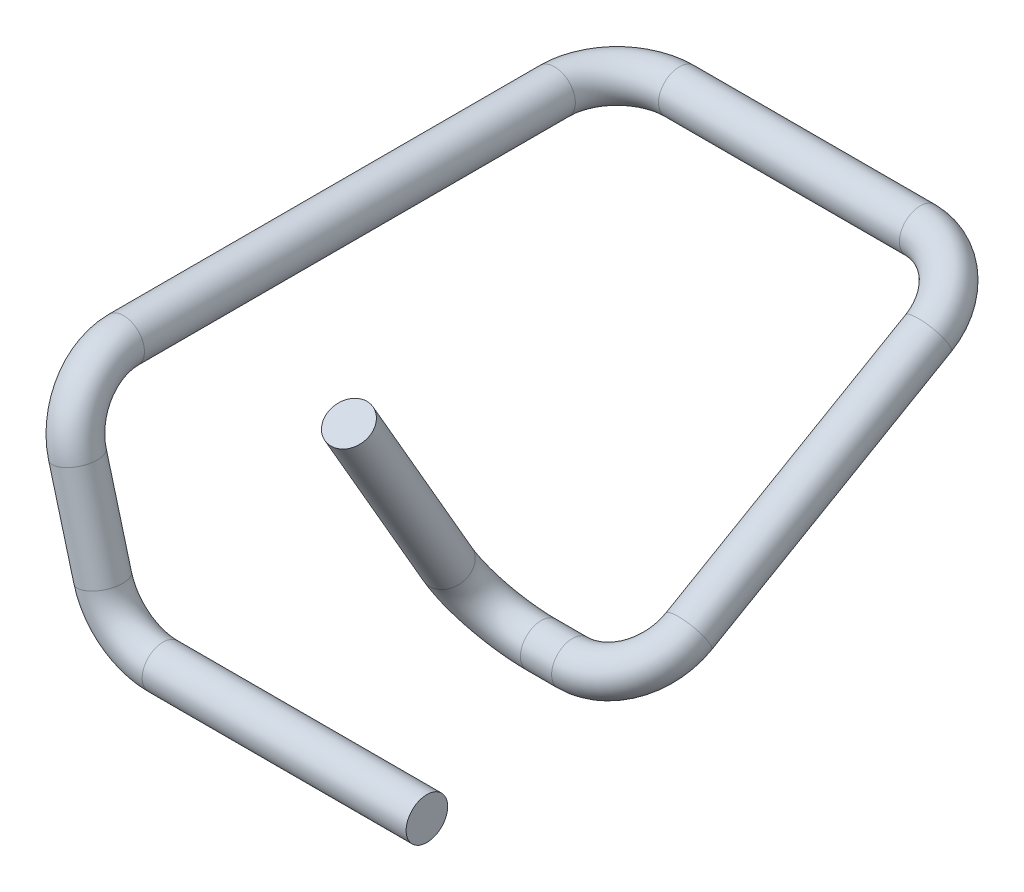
ISO-10303-21;
HEADER;
FILE_DESCRIPTION(('STEP AP214'),'2;1');
FILE_NAME('part.step','',(''),(''),'','','');
FILE_SCHEMA(('AUTOMOTIVE_DESIGN { 1 0 10303 214 1 1 1 1 }'));
ENDSEC;
DATA;
#1=APPLICATION_CONTEXT('core data for automotive mechanical design processes');
#2=APPLICATION_PROTOCOL_DEFINITION('international standard','automotive_design',2000,#1);
#3=PRODUCT_CONTEXT('',#1,'mechanical');
#4=PRODUCT('Part','Part','',(#3));
#5=PRODUCT_RELATED_PRODUCT_CATEGORY('part','',(#4));
#6=PRODUCT_DEFINITION_FORMATION('','',#4);
#7=PRODUCT_DEFINITION_CONTEXT('part definition',#1,'design');
#8=PRODUCT_DEFINITION('design','',#6,#7);
#9=PRODUCT_DEFINITION_SHAPE('','',#8);
#10=(LENGTH_UNIT() NAMED_UNIT(*) SI_UNIT(.MILLI.,.METRE.));
#11=(NAMED_UNIT(*) PLANE_ANGLE_UNIT() SI_UNIT($,.RADIAN.));
#12=(NAMED_UNIT(*) SI_UNIT($,.STERADIAN.) SOLID_ANGLE_UNIT());
#13=UNCERTAINTY_MEASURE_WITH_UNIT(LENGTH_MEASURE(1.E-05),#10,'distance_accuracy_value','');
#14=(GEOMETRIC_REPRESENTATION_CONTEXT(3) GLOBAL_UNCERTAINTY_ASSIGNED_CONTEXT((#13)) GLOBAL_UNIT_ASSIGNED_CONTEXT((#10,
#11,#12)) REPRESENTATION_CONTEXT('',''));
#15=CARTESIAN_POINT('',(0.,0.,0.));
#16=DIRECTION('',(0.,0.,1.));
#17=DIRECTION('',(1.,0.,0.));
#18=AXIS2_PLACEMENT_3D('',#15,#16,#17);
#19=CARTESIAN_POINT('',(0.,0.,0.));
#20=DIRECTION('',(1.,0.,0.));
#21=DIRECTION('',(0.,0.707106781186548,-0.707106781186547));
#22=AXIS2_PLACEMENT_3D('',#19,#20,#21);
#23=PLANE('',#22);
#24=CARTESIAN_POINT('',(0.,0.,0.));
#25=DIRECTION('',(1.,0.,0.));
#26=DIRECTION('',(0.,0.707106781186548,-0.707106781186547));
#27=AXIS2_PLACEMENT_3D('',#24,#25,#26);
#28=CIRCLE('',#27,9.99999999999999);
#29=CARTESIAN_POINT('',(0.,7.07106781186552,-7.07106781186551));
#30=VERTEX_POINT('',#29);
#31=EDGE_CURVE('E56',#30,#30,#28,.T.);
#32=ORIENTED_EDGE('',*,*,#31,.T.);
#33=EDGE_LOOP('',(#32));
#34=FACE_BOUND('',#33,.T.);
#35=ADVANCED_FACE('F44',(#34),#23,.T.);
#36=CARTESIAN_POINT('',(-75.,108.253175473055,-37.5000000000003));
#37=DIRECTION('',(0.,-0.86602540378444,-0.499999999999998));
#38=DIRECTION('',(0.,0.499999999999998,-0.86602540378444));
#39=AXIS2_PLACEMENT_3D('',#36,#37,#38);
#40=PLANE('',#39);
#41=CARTESIAN_POINT('',(-75.,108.253175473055,-37.5000000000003));
#42=DIRECTION('',(0.,-0.86602540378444,-0.499999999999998));
#43=DIRECTION('',(0.,0.499999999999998,-0.86602540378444));
#44=AXIS2_PLACEMENT_3D('',#41,#42,#43);
#45=CIRCLE('',#44,9.99999999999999);
#46=CARTESIAN_POINT('',(-75.,113.253175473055,-46.1602540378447));
#47=VERTEX_POINT('',#46);
#48=EDGE_CURVE('E12',#47,#47,#45,.T.);
#49=ORIENTED_EDGE('',*,*,#48,.F.);
#50=EDGE_LOOP('',(#49));
#51=FACE_BOUND('',#50,.T.);
#52=ADVANCED_FACE('F62',(#51),#40,.F.);
#53=CARTESIAN_POINT('',(0.,0.,0.));
#54=DIRECTION('',(-1.,0.,0.));
#55=DIRECTION('',(0.,0.,1.));
#56=AXIS2_PLACEMENT_3D('',#53,#54,#55);
#57=CYLINDRICAL_SURFACE('',#56,9.99999999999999);
#58=CARTESIAN_POINT('',(-126.980190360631,0.,0.));
#59=DIRECTION('',(1.,0.,0.));
#60=DIRECTION('',(0.,0.707106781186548,-0.707106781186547));
#61=AXIS2_PLACEMENT_3D('',#58,#59,#60);
#62=CIRCLE('',#61,9.99999999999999);
#63=CARTESIAN_POINT('',(-126.980190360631,-9.99999999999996,0.));
#64=VERTEX_POINT('',#63);
#65=EDGE_CURVE('E128',#64,#64,#62,.T.);
#66=ORIENTED_EDGE('',*,*,#65,.T.);
#67=EDGE_LOOP('',(#66));
#68=FACE_BOUND('',#67,.T.);
#69=ORIENTED_EDGE('',*,*,#31,.F.);
#70=EDGE_LOOP('',(#69));
#71=FACE_BOUND('',#70,.T.);
#72=ADVANCED_FACE('F64',(#68,#71),#57,.T.);
#73=CARTESIAN_POINT('',(-126.980190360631,30.,0.));
#74=DIRECTION('',(0.,0.,-1.));
#75=DIRECTION('',(0.,1.,0.));
#76=AXIS2_PLACEMENT_3D('',#73,#74,#75);
#77=TOROIDAL_SURFACE('',#76,30.,9.99999999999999);
#78=CARTESIAN_POINT('',(-155.957965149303,22.2354286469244,0.));
#79=DIRECTION('',(0.258819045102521,-0.965925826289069,0.));
#80=DIRECTION('',(0.683012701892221,0.183012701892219,-0.707106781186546));
#81=AXIS2_PLACEMENT_3D('',#78,#79,#80);
#82=CIRCLE('',#81,9.99999999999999);
#83=CARTESIAN_POINT('',(-165.617223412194,19.6472381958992,0.));
#84=VERTEX_POINT('',#83);
#85=EDGE_CURVE('E125',#84,#84,#82,.T.);
#86=CARTESIAN_POINT('',(-126.980190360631,30.,0.));
#87=DIRECTION('',(0.,0.,-1.));
#88=DIRECTION('',(0.,1.,0.));
#89=AXIS2_PLACEMENT_3D('',#86,#87,#88);
#90=CIRCLE('',#89,40.);
#91=EDGE_CURVE('',#64,#84,#90,.T.);
#92=ORIENTED_EDGE('',*,*,#65,.F.);
#93=ORIENTED_EDGE('',*,*,#85,.T.);
#94=ORIENTED_EDGE('',*,*,#91,.T.);
#95=ORIENTED_EDGE('',*,*,#91,.F.);
#96=EDGE_LOOP('',(#92,#94,#93,#95));
#97=FACE_BOUND('',#96,.T.);
#98=ADVANCED_FACE('F69',(#97),#77,.T.);
#99=CARTESIAN_POINT('',(-155.957965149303,22.2354286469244,0.));
#100=DIRECTION('',(-0.25881904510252,0.965925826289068,0.));
#101=DIRECTION('',(-0.965925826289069,-0.25881904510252,0.));
#102=AXIS2_PLACEMENT_3D('',#99,#100,#101);
#103=CYLINDRICAL_SURFACE('',#102,9.99999999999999);
#104=CARTESIAN_POINT('',(-168.117333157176,67.6148078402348,0.));
#105=DIRECTION('',(0.25881904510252,-0.965925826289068,0.));
#106=DIRECTION('',(0.683012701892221,0.183012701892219,-0.707106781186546));
#107=AXIS2_PLACEMENT_3D('',#104,#105,#106);
#108=CIRCLE('',#107,9.99999999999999);
#109=CARTESIAN_POINT('',(-168.117333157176,67.6148078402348,9.99999999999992));
#110=VERTEX_POINT('',#109);
#111=EDGE_CURVE('E130',#110,#110,#108,.T.);
#112=ORIENTED_EDGE('',*,*,#111,.T.);
#113=EDGE_LOOP('',(#112));
#114=FACE_BOUND('',#113,.T.);
#115=ORIENTED_EDGE('',*,*,#85,.F.);
#116=EDGE_LOOP('',(#115));
#117=FACE_BOUND('',#116,.T.);
#118=ADVANCED_FACE('F113',(#114,#117),#103,.T.);
#119=CARTESIAN_POINT('',(-168.117333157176,67.6148078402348,-30.));
#120=DIRECTION('',(-0.965925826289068,-0.25881904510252,0.));
#121=DIRECTION('',(0.25881904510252,-0.965925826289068,0.));
#122=AXIS2_PLACEMENT_3D('',#119,#120,#121);
#123=TOROIDAL_SURFACE('',#122,30.,9.99999999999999);
#124=CARTESIAN_POINT('',(-175.881904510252,96.5925826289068,-30.0000000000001));
#125=DIRECTION('',(0.,0.,1.));
#126=DIRECTION('',(0.86602540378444,-0.499999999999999,0.));
#127=AXIS2_PLACEMENT_3D('',#124,#125,#126);
#128=CIRCLE('',#127,9.99999999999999);
#129=CARTESIAN_POINT('',(-178.470094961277,106.251840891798,-30.0000000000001));
#130=VERTEX_POINT('',#129);
#131=EDGE_CURVE('E136',#130,#130,#128,.T.);
#132=CARTESIAN_POINT('',(-168.117333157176,67.6148078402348,-30.));
#133=DIRECTION('',(-0.965925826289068,-0.25881904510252,0.));
#134=DIRECTION('',(0.25881904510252,-0.965925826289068,0.));
#135=AXIS2_PLACEMENT_3D('',#132,#133,#134);
#136=CIRCLE('',#135,40.);
#137=EDGE_CURVE('',#110,#130,#136,.T.);
#138=ORIENTED_EDGE('',*,*,#111,.F.);
#139=ORIENTED_EDGE('',*,*,#131,.T.);
#140=ORIENTED_EDGE('',*,*,#137,.T.);
#141=ORIENTED_EDGE('',*,*,#137,.F.);
#142=EDGE_LOOP('',(#138,#140,#139,#141));
#143=FACE_BOUND('',#142,.T.);
#144=ADVANCED_FACE('F109',(#143),#123,.T.);
#145=CARTESIAN_POINT('',(-175.881904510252,96.5925826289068,-30.));
#146=DIRECTION('',(0.,0.,-1.));
#147=DIRECTION('',(0.,1.,0.));
#148=AXIS2_PLACEMENT_3D('',#145,#146,#147);
#149=CYLINDRICAL_SURFACE('',#148,9.99999999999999);
#150=CARTESIAN_POINT('',(-175.881904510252,96.5925826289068,-237.303260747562));
#151=DIRECTION('',(0.,0.,1.));
#152=DIRECTION('',(0.86602540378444,-0.499999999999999,0.));
#153=AXIS2_PLACEMENT_3D('',#150,#151,#152);
#154=CIRCLE('',#153,9.99999999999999);
#155=CARTESIAN_POINT('',(-185.881904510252,96.5925826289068,-237.303260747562));
#156=VERTEX_POINT('',#155);
#157=EDGE_CURVE('E139',#156,#156,#154,.T.);
#158=ORIENTED_EDGE('',*,*,#157,.T.);
#159=EDGE_LOOP('',(#158));
#160=FACE_BOUND('',#159,.T.);
#161=ORIENTED_EDGE('',*,*,#131,.F.);
#162=EDGE_LOOP('',(#161));
#163=FACE_BOUND('',#162,.T.);
#164=ADVANCED_FACE('F105',(#160,#163),#149,.T.);
#165=CARTESIAN_POINT('',(-145.881904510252,96.5925826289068,-237.303260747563));
#166=DIRECTION('',(0.,-1.,0.));
#167=DIRECTION('',(0.,0.,-1.));
#168=AXIS2_PLACEMENT_3D('',#165,#166,#167);
#169=TOROIDAL_SURFACE('',#168,29.9999999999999,9.99999999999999);
#170=CARTESIAN_POINT('',(-145.881904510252,96.5925826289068,-267.303260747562));
#171=DIRECTION('',(-1.,0.,0.));
#172=DIRECTION('',(0.,-0.499999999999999,0.86602540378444));
#173=AXIS2_PLACEMENT_3D('',#170,#171,#172);
#174=CIRCLE('',#173,9.99999999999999);
#175=CARTESIAN_POINT('',(-145.881904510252,96.5925826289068,-277.303260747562));
#176=VERTEX_POINT('',#175);
#177=EDGE_CURVE('E142',#176,#176,#174,.T.);
#178=CARTESIAN_POINT('',(-145.881904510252,96.5925826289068,-237.303260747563));
#179=DIRECTION('',(0.,-1.,0.));
#180=DIRECTION('',(0.,0.,-1.));
#181=AXIS2_PLACEMENT_3D('',#178,#179,#180);
#182=CIRCLE('',#181,39.9999999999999);
#183=EDGE_CURVE('',#156,#176,#182,.T.);
#184=ORIENTED_EDGE('',*,*,#157,.F.);
#185=ORIENTED_EDGE('',*,*,#177,.T.);
#186=ORIENTED_EDGE('',*,*,#183,.T.);
#187=ORIENTED_EDGE('',*,*,#183,.F.);
#188=EDGE_LOOP('',(#184,#186,#185,#187));
#189=FACE_BOUND('',#188,.T.);
#190=ADVANCED_FACE('F101',(#189),#169,.T.);
#191=CARTESIAN_POINT('',(-145.881904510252,96.5925826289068,-267.303260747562));
#192=DIRECTION('',(1.,0.,0.));
#193=DIRECTION('',(0.,0.,-1.));
#194=AXIS2_PLACEMENT_3D('',#191,#192,#193);
#195=CYLINDRICAL_SURFACE('',#194,9.99999999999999);
#196=CARTESIAN_POINT('',(-30.0000000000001,96.5925826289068,-267.303260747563));
#197=DIRECTION('',(-1.,0.,0.));
#198=DIRECTION('',(0.,-0.499999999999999,0.86602540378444));
#199=AXIS2_PLACEMENT_3D('',#196,#197,#198);
#200=CIRCLE('',#199,9.99999999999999);
#201=CARTESIAN_POINT('',(-30.0000000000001,101.592582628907,-275.963514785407));
#202=VERTEX_POINT('',#201);
#203=EDGE_CURVE('E145',#202,#202,#200,.T.);
#204=ORIENTED_EDGE('',*,*,#203,.T.);
#205=EDGE_LOOP('',(#204));
#206=FACE_BOUND('',#205,.T.);
#207=ORIENTED_EDGE('',*,*,#177,.F.);
#208=EDGE_LOOP('',(#207));
#209=FACE_BOUND('',#208,.T.);
#210=ADVANCED_FACE('F97',(#206,#209),#195,.T.);
#211=CARTESIAN_POINT('',(-30.0000000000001,81.5925826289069,-241.322498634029));
#212=DIRECTION('',(0.,-0.866025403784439,-0.499999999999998));
#213=DIRECTION('',(0.,0.499999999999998,-0.86602540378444));
#214=AXIS2_PLACEMENT_3D('',#211,#212,#213);
#215=TOROIDAL_SURFACE('',#214,30.,9.99999999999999);
#216=CARTESIAN_POINT('',(-1.2490009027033E-13,81.5925826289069,-241.322498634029));
#217=DIRECTION('',(0.,0.499999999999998,-0.86602540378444));
#218=DIRECTION('',(-1.,0.,0.));
#219=AXIS2_PLACEMENT_3D('',#216,#217,#218);
#220=CIRCLE('',#219,9.99999999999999);
#221=CARTESIAN_POINT('',(9.99999999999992,81.5925826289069,-241.322498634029));
#222=VERTEX_POINT('',#221);
#223=EDGE_CURVE('E148',#222,#222,#220,.T.);
#224=CARTESIAN_POINT('',(-30.0000000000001,81.5925826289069,-241.322498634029));
#225=DIRECTION('',(0.,-0.866025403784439,-0.499999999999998));
#226=DIRECTION('',(0.,0.499999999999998,-0.86602540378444));
#227=AXIS2_PLACEMENT_3D('',#224,#225,#226);
#228=CIRCLE('',#227,40.);
#229=EDGE_CURVE('',#202,#222,#228,.T.);
#230=ORIENTED_EDGE('',*,*,#203,.F.);
#231=ORIENTED_EDGE('',*,*,#223,.T.);
#232=ORIENTED_EDGE('',*,*,#229,.T.);
#233=ORIENTED_EDGE('',*,*,#229,.F.);
#234=EDGE_LOOP('',(#230,#232,#231,#233));
#235=FACE_BOUND('',#234,.T.);
#236=ADVANCED_FACE('F93',(#235),#215,.T.);
#237=CARTESIAN_POINT('',(-1.38777878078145E-13,81.5925826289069,-241.322498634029));
#238=DIRECTION('',(0.,-0.499999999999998,0.86602540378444));
#239=DIRECTION('',(0.,-0.86602540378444,-0.499999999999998));
#240=AXIS2_PLACEMENT_3D('',#237,#238,#239);
#241=CYLINDRICAL_SURFACE('',#240,9.99999999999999);
#242=CARTESIAN_POINT('',(0.,14.9999999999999,-125.980762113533));
#243=DIRECTION('',(0.,0.499999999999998,-0.86602540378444));
#244=DIRECTION('',(-1.,0.,0.));
#245=AXIS2_PLACEMENT_3D('',#242,#243,#244);
#246=CIRCLE('',#245,9.99999999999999);
#247=CARTESIAN_POINT('',(9.99999999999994,14.9999999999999,-125.980762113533));
#248=VERTEX_POINT('',#247);
#249=EDGE_CURVE('E151',#248,#248,#246,.T.);
#250=ORIENTED_EDGE('',*,*,#249,.T.);
#251=EDGE_LOOP('',(#250));
#252=FACE_BOUND('',#251,.T.);
#253=ORIENTED_EDGE('',*,*,#223,.F.);
#254=EDGE_LOOP('',(#253));
#255=FACE_BOUND('',#254,.T.);
#256=ADVANCED_FACE('F89',(#252,#255),#241,.T.);
#257=CARTESIAN_POINT('',(-30.,14.9999999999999,-125.980762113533));
#258=DIRECTION('',(0.,-0.86602540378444,-0.499999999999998));
#259=DIRECTION('',(0.,0.499999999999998,-0.86602540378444));
#260=AXIS2_PLACEMENT_3D('',#257,#258,#259);
#261=TOROIDAL_SURFACE('',#260,30.,9.99999999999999);
#262=CARTESIAN_POINT('',(-30.,0.,-100.));
#263=DIRECTION('',(1.,0.,0.));
#264=DIRECTION('',(0.,0.499999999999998,-0.86602540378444));
#265=AXIS2_PLACEMENT_3D('',#262,#263,#264);
#266=CIRCLE('',#265,9.99999999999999);
#267=CARTESIAN_POINT('',(-30.,-4.99999999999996,-91.3397459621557));
#268=VERTEX_POINT('',#267);
#269=EDGE_CURVE('E154',#268,#268,#266,.T.);
#270=CARTESIAN_POINT('',(-30.,14.9999999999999,-125.980762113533));
#271=DIRECTION('',(0.,-0.86602540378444,-0.499999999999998));
#272=DIRECTION('',(0.,0.499999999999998,-0.86602540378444));
#273=AXIS2_PLACEMENT_3D('',#270,#271,#272);
#274=CIRCLE('',#273,40.);
#275=EDGE_CURVE('',#248,#268,#274,.T.);
#276=ORIENTED_EDGE('',*,*,#249,.F.);
#277=ORIENTED_EDGE('',*,*,#269,.T.);
#278=ORIENTED_EDGE('',*,*,#275,.T.);
#279=ORIENTED_EDGE('',*,*,#275,.F.);
#280=EDGE_LOOP('',(#276,#278,#277,#279));
#281=FACE_BOUND('',#280,.T.);
#282=ADVANCED_FACE('F85',(#281),#261,.T.);
#283=CARTESIAN_POINT('',(-30.,0.,-100.));
#284=DIRECTION('',(-1.,0.,0.));
#285=DIRECTION('',(0.,0.,1.));
#286=AXIS2_PLACEMENT_3D('',#283,#284,#285);
#287=CYLINDRICAL_SURFACE('',#286,9.99999999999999);
#288=CARTESIAN_POINT('',(-45.,0.,-100.));
#289=DIRECTION('',(1.,0.,0.));
#290=DIRECTION('',(0.,0.499999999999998,-0.86602540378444));
#291=AXIS2_PLACEMENT_3D('',#288,#289,#290);
#292=CIRCLE('',#291,9.99999999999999);
#293=CARTESIAN_POINT('',(-45.,-8.66025403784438,-105.));
#294=VERTEX_POINT('',#293);
#295=EDGE_CURVE('E157',#294,#294,#292,.T.);
#296=ORIENTED_EDGE('',*,*,#295,.T.);
#297=EDGE_LOOP('',(#296));
#298=FACE_BOUND('',#297,.T.);
#299=ORIENTED_EDGE('',*,*,#269,.F.);
#300=EDGE_LOOP('',(#299));
#301=FACE_BOUND('',#300,.T.);
#302=ADVANCED_FACE('F79',(#298,#301),#287,.T.);
#303=CARTESIAN_POINT('',(-45.,25.9807621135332,-85.0000000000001));
#304=DIRECTION('',(0.,0.499999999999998,-0.86602540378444));
#305=DIRECTION('',(0.,0.86602540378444,0.499999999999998));
#306=AXIS2_PLACEMENT_3D('',#303,#304,#305);
#307=TOROIDAL_SURFACE('',#306,30.,9.99999999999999);
#308=CARTESIAN_POINT('',(-74.9999999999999,25.9807621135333,-85.));
#309=DIRECTION('',(0.,-0.86602540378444,-0.499999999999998));
#310=DIRECTION('',(0.,0.499999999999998,-0.86602540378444));
#311=AXIS2_PLACEMENT_3D('',#308,#309,#310);
#312=CIRCLE('',#311,9.99999999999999);
#313=CARTESIAN_POINT('',(-85.,25.9807621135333,-85.));
#314=VERTEX_POINT('',#313);
#315=EDGE_CURVE('E51',#314,#314,#312,.T.);
#316=CARTESIAN_POINT('',(-45.,25.9807621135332,-85.0000000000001));
#317=DIRECTION('',(0.,0.499999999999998,-0.86602540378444));
#318=DIRECTION('',(0.,0.86602540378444,0.499999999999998));
#319=AXIS2_PLACEMENT_3D('',#316,#317,#318);
#320=CIRCLE('',#319,40.);
#321=EDGE_CURVE('',#294,#314,#320,.T.);
#322=ORIENTED_EDGE('',*,*,#295,.F.);
#323=ORIENTED_EDGE('',*,*,#315,.T.);
#324=ORIENTED_EDGE('',*,*,#321,.T.);
#325=ORIENTED_EDGE('',*,*,#321,.F.);
#326=EDGE_LOOP('',(#322,#324,#323,#325));
#327=FACE_BOUND('',#326,.T.);
#328=ADVANCED_FACE('F75',(#327),#307,.T.);
#329=CARTESIAN_POINT('',(-75.,25.9807621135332,-85.0000000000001));
#330=DIRECTION('',(0.,0.86602540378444,0.499999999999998));
#331=DIRECTION('',(0.,-0.499999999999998,0.86602540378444));
#332=AXIS2_PLACEMENT_3D('',#329,#330,#331);
#333=CYLINDRICAL_SURFACE('',#332,9.99999999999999);
#334=ORIENTED_EDGE('',*,*,#48,.T.);
#335=EDGE_LOOP('',(#334));
#336=FACE_BOUND('',#335,.T.);
#337=ORIENTED_EDGE('',*,*,#315,.F.);
#338=EDGE_LOOP('',(#337));
#339=FACE_BOUND('',#338,.T.);
#340=ADVANCED_FACE('F59',(#336,#339),#333,.T.);
#341=CLOSED_SHELL('',(#35,#52,#72,#98,#118,#144,#164,#190,#210,#236,#256,#282,#302,#328,#340));
#342=MANIFOLD_SOLID_BREP('B2',#341);
#343=ADVANCED_BREP_SHAPE_REPRESENTATION('',(#18,#342),#14);
#344=SHAPE_DEFINITION_REPRESENTATION(#9,#343);
ENDSEC;
END-ISO-10303-21;
